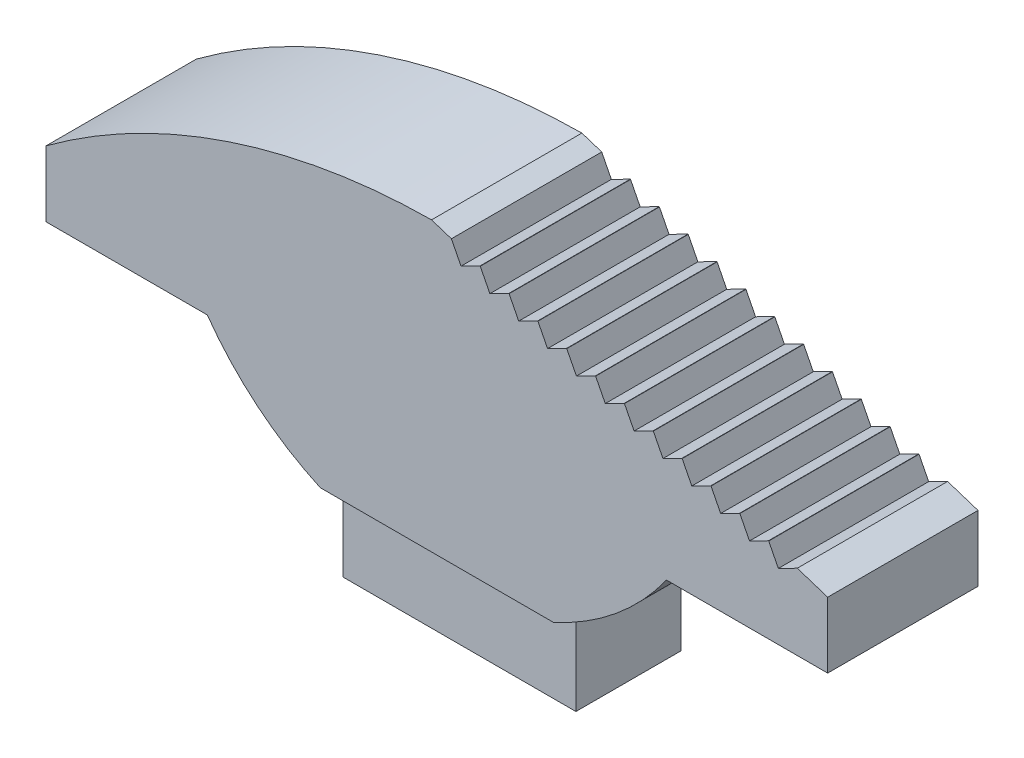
from build123d import *

# Parameters (mm, degrees)
BOSS_EXTRUDE1_DEPTH      = 0.7112
BOSS_EXTRUDE1_DEPTH_BACK = 0.7112
CUT_EXTRUDE1_DEPTH       = 12.516966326
BOSS_EXTRUDE2_DEPTH      = 0.3048
BOSS_EXTRUDE2_DEPTH_BACK = 1.7272
SKETCH4_W                = 3.15
SKETCH4_H                = 1.90013072
CUT_EXTRUDE2_DEPTH       = 12.558568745


with BuildPart() as part:
    # Sketch1 → Boss-Extrude1 (new, two sides: drawn at the far end of the back side and taken through both)
    with BuildSketch(Plane.XY.offset(-BOSS_EXTRUDE1_DEPTH_BACK)):
        with BuildLine():
            Line((0, 0), (2.18, 0))
            ThreePointArc((2.18, 0), (2.86079408, -0.730471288), (3.708, -1.258970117))
            Line((3.708, -1.258970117), (3.708, -4.356252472))
            Line((3.708, -4.356252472), (6.858, -4.356252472))
            Line((6.858, -4.356252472), (6.858, -1.258970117))
            ThreePointArc((6.858, -1.258970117), (7.705835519, -0.730852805), (8.387092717, 0))
            Line((8.387092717, 0), (10.566, 0))
            Line((10.566, 0), (10.566, 0.889))
            Line((10.566, 0.889), (5.211607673, 2.628747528))
            ThreePointArc((5.211607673, 2.628747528), (2.468029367, 2.171592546), (0, 0.889))
            Line((0, 0.889), (0, 0))
        make_face()
    extrude(amount=BOSS_EXTRUDE1_DEPTH + BOSS_EXTRUDE1_DEPTH_BACK)

    # Sketch2 → Cut-Extrude1 (cut, through all)
    with BuildSketch(Plane.XY.offset(0.7112)):
        Polygon((9.769014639, 1.147956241), (9.899348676, 0.892161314), (10.155143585, 1.022495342), align=None)
        Polygon((9.509415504, 1.018858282), (9.765210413, 1.149192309), (9.379081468, 1.274653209), align=None)
        Polygon((9.119482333, 1.14555525), (9.375277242, 1.275889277), (8.989148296, 1.401350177), align=None)
        Polygon((8.729549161, 1.272252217), (8.98534407, 1.402586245), (8.599215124, 1.528047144), align=None)
        Polygon((8.339615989, 1.398949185), (8.595410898, 1.529283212), (8.209281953, 1.654744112), align=None)
        Polygon((7.949682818, 1.525646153), (8.205477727, 1.65598018), (7.819348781, 1.78144108), align=None)
        Polygon((7.559749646, 1.65234312), (7.815544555, 1.782677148), (7.429415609, 1.908138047), align=None)
        Polygon((7.169816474, 1.779040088), (7.425611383, 1.909374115), (7.039482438, 2.034835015), align=None)
        Polygon((6.779883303, 1.905737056), (7.035678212, 2.036071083), (6.649549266, 2.161531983), align=None)
        Polygon((6.389950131, 2.032434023), (6.64574504, 2.162768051), (6.259616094, 2.288228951), align=None)
        Polygon((6.000016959, 2.159130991), (6.255811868, 2.289465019), (5.869682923, 2.414925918), align=None)
        Polygon((5.610083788, 2.285827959), (5.865878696, 2.416161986), (5.479749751, 2.541622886), align=None)
    extrude(amount=-CUT_EXTRUDE1_DEPTH, mode=Mode.SUBTRACT)

    # Sketch3 → Boss-Extrude2 (add, two sides: drawn at the far end of the back side and taken through both)
    with BuildSketch(Plane.XY.offset(0.7112).offset(-BOSS_EXTRUDE2_DEPTH_BACK)):
        with BuildLine():
            Line((3.708, -1.258970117), (6.858, -1.259466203))
            ThreePointArc((6.858, -1.259466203), (7.705835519, -0.730852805), (8.387092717, 0))
            Line((8.387092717, 0), (10.566, 0))
            Line((10.566, 0), (10.566, 0.889))
            Line((10.566, 0.889), (10.155143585, 1.022495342))
            Line((10.155143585, 1.022495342), (9.899348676, 0.892161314))
            Line((9.899348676, 0.892161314), (9.769014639, 1.147956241))
            Line((9.769014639, 1.147956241), (9.765210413, 1.149192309))
            Line((9.765210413, 1.149192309), (9.509415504, 1.018858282))
            Line((9.509415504, 1.018858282), (9.379081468, 1.274653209))
            Line((9.379081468, 1.274653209), (9.375277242, 1.275889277))
            Line((9.375277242, 1.275889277), (9.119482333, 1.14555525))
            Line((9.119482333, 1.14555525), (8.989148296, 1.401350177))
            Line((8.989148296, 1.401350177), (8.98534407, 1.402586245))
            Line((8.98534407, 1.402586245), (8.729549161, 1.272252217))
            Line((8.729549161, 1.272252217), (8.599215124, 1.528047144))
            Line((8.599215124, 1.528047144), (8.595410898, 1.529283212))
            Line((8.595410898, 1.529283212), (8.339615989, 1.398949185))
            Line((8.339615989, 1.398949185), (8.209281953, 1.654744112))
            Line((8.209281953, 1.654744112), (8.205477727, 1.65598018))
            Line((8.205477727, 1.65598018), (7.949682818, 1.525646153))
            Line((7.949682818, 1.525646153), (7.819348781, 1.78144108))
            Line((7.819348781, 1.78144108), (7.815544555, 1.782677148))
            Line((7.815544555, 1.782677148), (7.559749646, 1.65234312))
            Line((7.559749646, 1.65234312), (7.429415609, 1.908138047))
            Line((7.429415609, 1.908138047), (7.425611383, 1.909374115))
            Line((7.425611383, 1.909374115), (7.169816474, 1.779040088))
            Line((7.169816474, 1.779040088), (7.039482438, 2.034835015))
            Line((7.039482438, 2.034835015), (7.035678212, 2.036071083))
            Line((7.035678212, 2.036071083), (6.779883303, 1.905737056))
            Line((6.779883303, 1.905737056), (6.649549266, 2.161531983))
            Line((6.649549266, 2.161531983), (6.64574504, 2.162768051))
            Line((6.64574504, 2.162768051), (6.389950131, 2.032434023))
            Line((6.389950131, 2.032434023), (6.259616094, 2.288228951))
            Line((6.259616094, 2.288228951), (6.255811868, 2.289465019))
            Line((6.255811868, 2.289465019), (6.000016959, 2.159130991))
            Line((6.000016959, 2.159130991), (5.869682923, 2.414925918))
            Line((5.869682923, 2.414925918), (5.865878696, 2.416161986))
            Line((5.865878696, 2.416161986), (5.610083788, 2.285827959))
            Line((5.610083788, 2.285827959), (5.479749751, 2.541622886))
            Line((5.479749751, 2.541622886), (5.211607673, 2.628747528))
            ThreePointArc((5.211607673, 2.628747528), (2.468029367, 2.171592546), (0, 0.889))
            Line((0, 0.889), (0, 0))
            Line((0, 0), (2.18, 0))
            ThreePointArc((2.18, 0), (2.86079408, -0.730471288), (3.708, -1.258970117))
        make_face()
    extrude(amount=BOSS_EXTRUDE2_DEPTH + BOSS_EXTRUDE2_DEPTH_BACK)

    # Sketch4 → Cut-Extrude2 (cut, through all)
    with BuildSketch(Plane.XY.offset(0.7112)):
        with Locations((5.283, -3.406187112)):
            Rectangle(SKETCH4_W, SKETCH4_H)
    extrude(amount=-CUT_EXTRUDE2_DEPTH, mode=Mode.SUBTRACT)


solid = part.part
